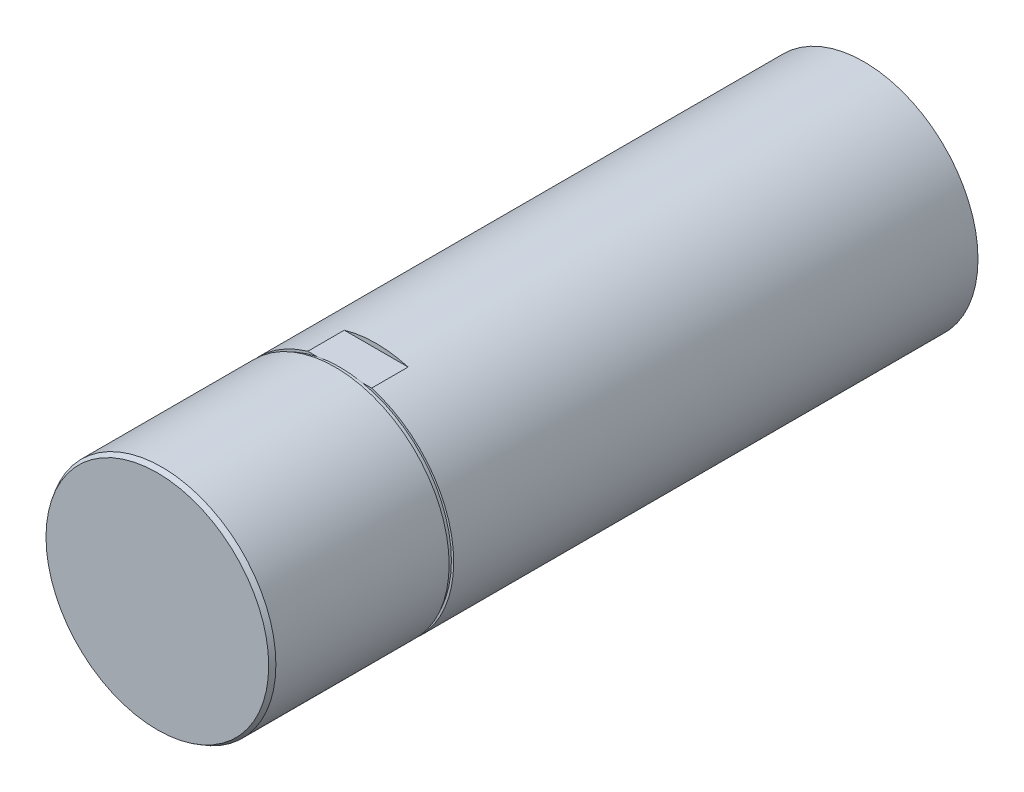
from build123d import *

# Parameters (mm, degrees)
SKETCH1_R        = 25
STROKE_DEPTH     = 100
EXTRUDE_START    = 15
SKETCH2_R        = 25
EXTRUDE_L2_DEPTH = 15
EXTRUDE_START_2  = 40
SKETCH3_R        = 25
EXTRUDE_L3_DEPTH = 40
CHAMFER2_SIZE    = 1
CHAMFER2_SIZE2   = 0.577350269
U_C_START        = 1
SKETCH5_R        = 25
SKETCH5_R_2      = 24.5
U_C_DEPTH        = 1
SKETCH6_W        = 8
SKETCH6_H        = 1.5
A_F_DEPTH        = 10.5


with BuildPart() as part:
    # Sketch1 → STROKE (new body)
    with BuildSketch(Plane.XY):
        Circle(SKETCH1_R)
    extrude(amount=-STROKE_DEPTH)

    # Sketch2 → Extrude L2 (add)
    with BuildSketch(Plane.XY.offset(EXTRUDE_START)):
        Circle(SKETCH2_R)
    extrude(amount=-EXTRUDE_L2_DEPTH)

    # Sketch3 → Extrude L3 (add)
    with BuildSketch(Plane.XY.offset(15).offset(EXTRUDE_START_2)):
        Circle(SKETCH3_R)
    extrude(amount=-EXTRUDE_L3_DEPTH)

    # Chamfer2
    chamfer2_edges = [part.edges().sort_by_distance(p)[0] for p in [
        (-25, 0, 55),
    ]]
    chamfer2_side = [part.faces().sort_by_distance(p)[0] for p in [
        (-25, 0, -22.5),
    ]]
    chamfer(chamfer2_edges, length=CHAMFER2_SIZE, length2=CHAMFER2_SIZE2, reference=chamfer2_side[0])

    # Sketch5 → U_C (cut)
    with BuildSketch(Plane.XY.offset(15).offset(U_C_START)):
        Circle(SKETCH5_R)
        Circle(SKETCH5_R_2, mode=Mode.SUBTRACT)
    extrude(amount=-U_C_DEPTH, mode=Mode.SUBTRACT)

    # Sketch6 → A_F (cut, symmetric)
    with BuildSketch(Plane(origin=(0, 0, 0), x_dir=(0, 0, -1), z_dir=(1, 0, 0))):
        with Locations((-11, 24.75)):
            Rectangle(SKETCH6_W, SKETCH6_H)
        with Locations((-11, -24.75)):
            Rectangle(SKETCH6_W, SKETCH6_H)
    extrude(amount=A_F_DEPTH, both=True, mode=Mode.SUBTRACT)


solid = part.part
